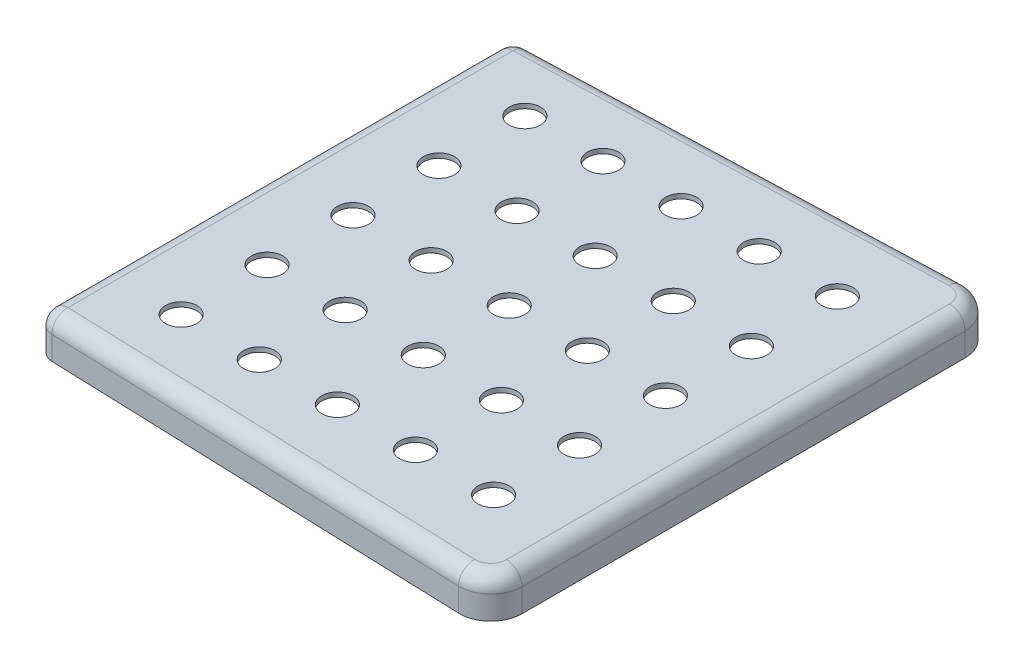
from build123d import *

# Parameters (mm, degrees)
BOSS_EXTRU_1_DEPTH              = 25
CONG_1_R                        = 10
CONG_2_R                        = 20
CONG_3_R                        = 10
COQUE1_T                        = -3
ESQUISSE3_R                     = 10
ENL_V_MAT_EXTRU_1_DEPTH         = 223.037852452
R_P_TITION_LIN_AIRE1_COUNT      = 5
R_P_TITION_LIN_AIRE1_PITCH      = 50
R_P_TITION_LIN_AIRE1_COUNT_DIR2 = 5
R_P_TITION_LIN_AIRE1_PITCH_DIR2 = 55


with BuildPart() as part:
    # Esquisse2 → Boss.-Extru.1 (new body)
    with BuildSketch(Plane(origin=(0, 0, 0), x_dir=(1, 0, 0), z_dir=(0, 1, 0))):
        Polygon((-150, 152.023769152), (150, 162.5), (150, -162.5), (-150, -152.023769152), align=None)
    extrude(amount=-BOSS_EXTRU_1_DEPTH)

    # Cong_1
    cong_1_edges = [part.edges().sort_by_distance(p)[0] for p in [
        (-150, -12.5, 152.023769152),
        (-150, -12.5, -152.023769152),
    ]]
    fillet(cong_1_edges, radius=CONG_1_R)

    # Cong_2
    cong_2_edges = [part.edges().sort_by_distance(p)[0] for p in [
        (150, -12.5, 162.5),
        (150, -12.5, -162.5),
    ]]
    fillet(cong_2_edges, radius=CONG_2_R)

    # Cong_3
    cong_3_edges = [part.edges().sort_by_distance(p)[0] for p in [
        (-150, 0, 0),
        (-5.523492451, 0, 157.06899997),
        (-147.193398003, 0, -149.313465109),
        (-147.193398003, 0, 149.313465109),
        (150, 0, 0),
        (-5.523492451, 0, -157.06899997),
        (143.893167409, 0, -156.176189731),
        (143.893167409, 0, 156.176189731),
    ]]
    fillet(cong_3_edges, radius=CONG_3_R)

    # Coque1
    coque1_openings = [part.faces().sort_by_distance(p)[0] for p in [
        (1.444093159, -25, 0),
    ]]
    offset(amount=COQUE1_T, openings=coque1_openings, kind=Kind.INTERSECTION)

    # Esquisse3 → Enl_v. mat.-Extru.1 (cut, through all)
    with BuildSketch(Plane(origin=(0, 0, 0), x_dir=(1, 0, 0), z_dir=(0, 1, 0))):
        with Locations(Location((-100, 110, 0), (0, 0, 270))):
            Circle(ESQUISSE3_R)
    enl_v_mat_extru_1 = extrude(amount=-ENL_V_MAT_EXTRU_1_DEPTH, mode=Mode.SUBTRACT)

    # R_p_tition lin_aire1: Enl_v. mat.-Extru.1 5 × 5
    with Locations(*[(i * R_P_TITION_LIN_AIRE1_PITCH, 0, j * R_P_TITION_LIN_AIRE1_PITCH_DIR2) for i in range(R_P_TITION_LIN_AIRE1_COUNT) for j in range(R_P_TITION_LIN_AIRE1_COUNT_DIR2) if (i, j) != (0, 0)]):
        add(enl_v_mat_extru_1, mode=Mode.SUBTRACT)


solid = part.part
